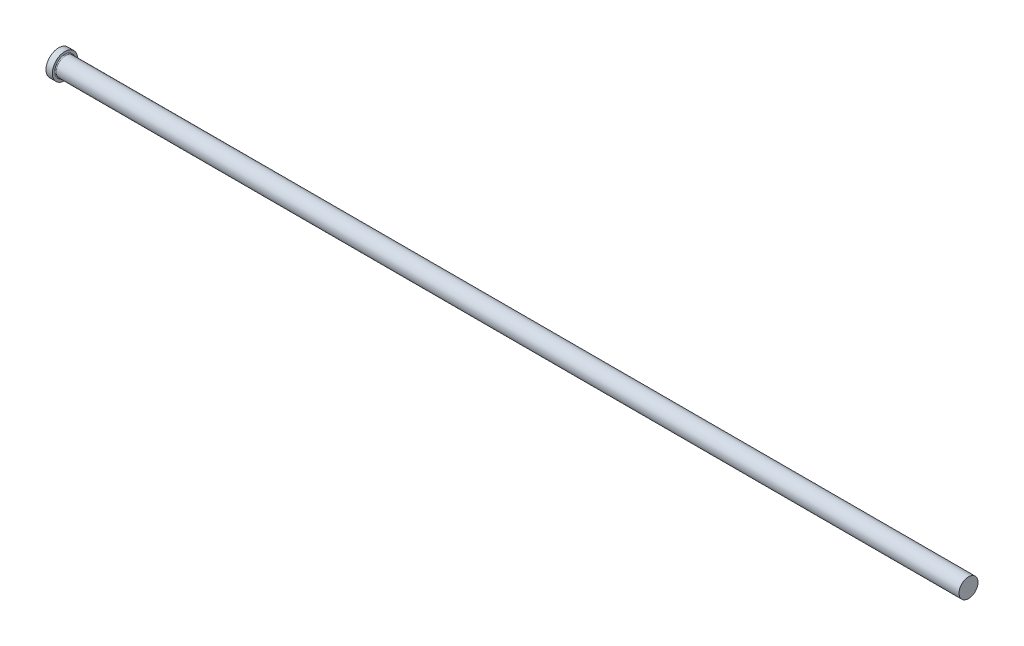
ISO-10303-21;
HEADER;
FILE_DESCRIPTION(('STEP AP214'),'2;1');
FILE_NAME('part.step','',(''),(''),'','','');
FILE_SCHEMA(('AUTOMOTIVE_DESIGN { 1 0 10303 214 1 1 1 1 }'));
ENDSEC;
DATA;
#1=APPLICATION_CONTEXT('core data for automotive mechanical design processes');
#2=APPLICATION_PROTOCOL_DEFINITION('international standard','automotive_design',2000,#1);
#3=PRODUCT_CONTEXT('',#1,'mechanical');
#4=PRODUCT('Part','Part','',(#3));
#5=PRODUCT_RELATED_PRODUCT_CATEGORY('part','',(#4));
#6=PRODUCT_DEFINITION_FORMATION('','',#4);
#7=PRODUCT_DEFINITION_CONTEXT('part definition',#1,'design');
#8=PRODUCT_DEFINITION('design','',#6,#7);
#9=PRODUCT_DEFINITION_SHAPE('','',#8);
#10=(LENGTH_UNIT() NAMED_UNIT(*) SI_UNIT(.MILLI.,.METRE.));
#11=(NAMED_UNIT(*) PLANE_ANGLE_UNIT() SI_UNIT($,.RADIAN.));
#12=(NAMED_UNIT(*) SI_UNIT($,.STERADIAN.) SOLID_ANGLE_UNIT());
#13=UNCERTAINTY_MEASURE_WITH_UNIT(LENGTH_MEASURE(1.E-05),#10,'distance_accuracy_value','');
#14=(GEOMETRIC_REPRESENTATION_CONTEXT(3) GLOBAL_UNCERTAINTY_ASSIGNED_CONTEXT((#13)) GLOBAL_UNIT_ASSIGNED_CONTEXT((#10,
#11,#12)) REPRESENTATION_CONTEXT('',''));
#15=CARTESIAN_POINT('',(0.,0.,0.));
#16=DIRECTION('',(0.,0.,1.));
#17=DIRECTION('',(1.,0.,0.));
#18=AXIS2_PLACEMENT_3D('',#15,#16,#17);
#19=CARTESIAN_POINT('',(0.,0.,0.));
#20=DIRECTION('',(1.,0.,0.));
#21=DIRECTION('',(0.,1.,0.));
#22=AXIS2_PLACEMENT_3D('',#19,#20,#21);
#23=PLANE('',#22);
#24=CARTESIAN_POINT('',(0.,0.,0.));
#25=DIRECTION('',(-1.,0.,0.));
#26=DIRECTION('',(0.,-1.,0.));
#27=AXIS2_PLACEMENT_3D('',#24,#25,#26);
#28=CIRCLE('',#27,12.6999999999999);
#29=CARTESIAN_POINT('',(0.,-12.6999999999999,0.));
#30=VERTEX_POINT('',#29);
#31=EDGE_CURVE('E10',#30,#30,#28,.T.);
#32=ORIENTED_EDGE('',*,*,#31,.T.);
#33=EDGE_LOOP('',(#32));
#34=FACE_BOUND('',#33,.T.);
#35=ADVANCED_FACE('F28',(#34),#23,.F.);
#36=CARTESIAN_POINT('',(914.4,0.,0.));
#37=DIRECTION('',(-1.,0.,0.));
#38=DIRECTION('',(0.,-1.,0.));
#39=AXIS2_PLACEMENT_3D('',#36,#37,#38);
#40=CYLINDRICAL_SURFACE('',#39,12.6999999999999);
#41=ORIENTED_EDGE('',*,*,#31,.F.);
#42=EDGE_LOOP('',(#41));
#43=FACE_BOUND('',#42,.T.);
#44=CARTESIAN_POINT('',(6.34999999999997,0.,0.));
#45=DIRECTION('',(-1.,0.,0.));
#46=DIRECTION('',(0.,-1.,0.));
#47=AXIS2_PLACEMENT_3D('',#44,#45,#46);
#48=CIRCLE('',#47,12.6999999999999);
#49=CARTESIAN_POINT('',(6.34999999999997,-12.6999999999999,0.));
#50=VERTEX_POINT('',#49);
#51=EDGE_CURVE('E34',#50,#50,#48,.T.);
#52=ORIENTED_EDGE('',*,*,#51,.T.);
#53=EDGE_LOOP('',(#52));
#54=FACE_BOUND('',#53,.T.);
#55=ADVANCED_FACE('F63',(#43,#54),#40,.T.);
#56=CARTESIAN_POINT('',(6.35,12.6999999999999,0.));
#57=DIRECTION('',(-1.,0.,0.));
#58=DIRECTION('',(0.,-1.,0.));
#59=AXIS2_PLACEMENT_3D('',#56,#57,#58);
#60=PLANE('',#59);
#61=ORIENTED_EDGE('',*,*,#51,.F.);
#62=EDGE_LOOP('',(#61));
#63=FACE_BOUND('',#62,.T.);
#64=CARTESIAN_POINT('',(6.34999999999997,0.,0.));
#65=DIRECTION('',(-1.,0.,0.));
#66=DIRECTION('',(0.,-1.,0.));
#67=AXIS2_PLACEMENT_3D('',#64,#65,#66);
#68=CIRCLE('',#67,10.30605);
#69=CARTESIAN_POINT('',(6.34999999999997,-10.30605,0.));
#70=VERTEX_POINT('',#69);
#71=EDGE_CURVE('E38',#70,#70,#68,.T.);
#72=ORIENTED_EDGE('',*,*,#71,.T.);
#73=EDGE_LOOP('',(#72));
#74=FACE_BOUND('',#73,.T.);
#75=ADVANCED_FACE('F67',(#63,#74),#60,.F.);
#76=CARTESIAN_POINT('',(7.1374,0.,0.));
#77=DIRECTION('',(-1.,0.,0.));
#78=DIRECTION('',(0.,-1.,0.));
#79=AXIS2_PLACEMENT_3D('',#76,#77,#78);
#80=TOROIDAL_SURFACE('',#79,10.30605,0.7874);
#81=ORIENTED_EDGE('',*,*,#71,.F.);
#82=EDGE_LOOP('',(#81));
#83=FACE_BOUND('',#82,.T.);
#84=CARTESIAN_POINT('',(7.13739999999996,0.,0.));
#85=DIRECTION('',(-1.,0.,0.));
#86=DIRECTION('',(0.,-1.,0.));
#87=AXIS2_PLACEMENT_3D('',#84,#85,#86);
#88=CIRCLE('',#87,9.51865);
#89=CARTESIAN_POINT('',(7.13739999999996,-9.51865,0.));
#90=VERTEX_POINT('',#89);
#91=EDGE_CURVE('E42',#90,#90,#88,.T.);
#92=ORIENTED_EDGE('',*,*,#91,.T.);
#93=EDGE_LOOP('',(#92));
#94=FACE_BOUND('',#93,.T.);
#95=ADVANCED_FACE('F59',(#83,#94),#80,.F.);
#96=CARTESIAN_POINT('',(914.4,0.,0.));
#97=DIRECTION('',(-1.,0.,0.));
#98=DIRECTION('',(0.,-1.,0.));
#99=AXIS2_PLACEMENT_3D('',#96,#97,#98);
#100=CYLINDRICAL_SURFACE('',#99,9.51864999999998);
#101=ORIENTED_EDGE('',*,*,#91,.F.);
#102=EDGE_LOOP('',(#101));
#103=FACE_BOUND('',#102,.T.);
#104=CARTESIAN_POINT('',(914.4,0.,0.));
#105=DIRECTION('',(-1.,0.,0.));
#106=DIRECTION('',(0.,-1.,0.));
#107=AXIS2_PLACEMENT_3D('',#104,#105,#106);
#108=CIRCLE('',#107,9.51864999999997);
#109=CARTESIAN_POINT('',(914.4,-9.51864999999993,0.));
#110=VERTEX_POINT('',#109);
#111=EDGE_CURVE('E47',#110,#110,#108,.T.);
#112=ORIENTED_EDGE('',*,*,#111,.T.);
#113=EDGE_LOOP('',(#112));
#114=FACE_BOUND('',#113,.T.);
#115=ADVANCED_FACE('F51',(#103,#114),#100,.T.);
#116=CARTESIAN_POINT('',(914.4,9.51865,0.));
#117=DIRECTION('',(-1.,0.,0.));
#118=DIRECTION('',(0.,-1.,0.));
#119=AXIS2_PLACEMENT_3D('',#116,#117,#118);
#120=PLANE('',#119);
#121=ORIENTED_EDGE('',*,*,#111,.F.);
#122=EDGE_LOOP('',(#121));
#123=FACE_BOUND('',#122,.T.);
#124=ADVANCED_FACE('F53',(#123),#120,.F.);
#125=CLOSED_SHELL('',(#35,#55,#75,#95,#115,#124));
#126=MANIFOLD_SOLID_BREP('B2',#125);
#127=ADVANCED_BREP_SHAPE_REPRESENTATION('',(#18,#126),#14);
#128=SHAPE_DEFINITION_REPRESENTATION(#9,#127);
ENDSEC;
END-ISO-10303-21;
